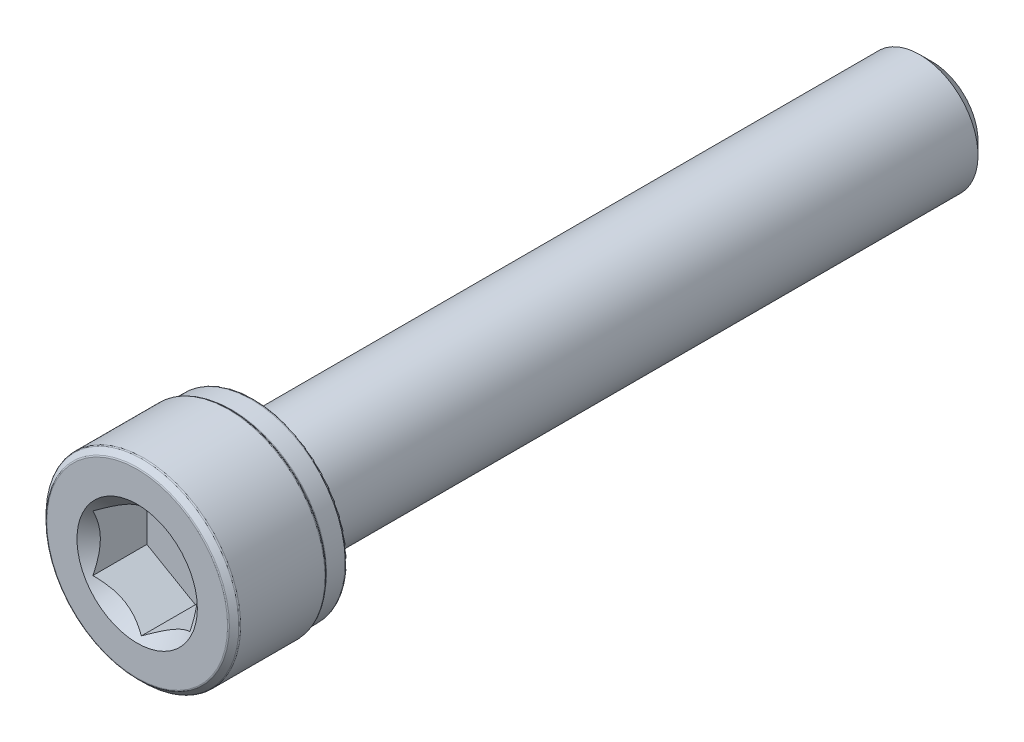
from build123d import *

# Parameters (mm, degrees)
CUT_EXTRUDE1_START = -3
CUT_EXTRUDE1_DEPTH = 3
SKETCH4_R          = 3.103257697
CUT_EXTRUDE2_DEPTH = 3
CUT_EXTRUDE2_TAPER = 45


with BuildPart() as part:
    # Sketch2 → Revolve1 (revolve)
    with BuildSketch(Plane(origin=(0, 0, 0), x_dir=(0, 0, -1), z_dir=(1, 0, 0))):
        with BuildLine():
            Line((-20.5, 0), (-20.5, 4.661167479))
            ThreePointArc((-20.5, 4.661167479), (-20.492863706, 4.69704405), (-20.472541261, 4.727458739))
            Line((-20.472541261, 4.727458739), (-20.227458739, 4.972541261))
            ThreePointArc((-20.227458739, 4.972541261), (-20.19704405, 4.992863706), (-20.161167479, 5))
            Line((-20.161167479, 5), (-15.813832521, 5))
            ThreePointArc((-15.813832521, 5), (-15.77795595, 4.992863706), (-15.747541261, 4.972541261))
            Line((-15.747541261, 4.972541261), (-15.652458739, 4.877458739))
            ThreePointArc((-15.652458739, 4.877458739), (-15.62204405, 4.857136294), (-15.586167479, 4.85))
            Line((-15.586167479, 4.85), (-14.625, 4.85))
            ThreePointArc((-14.625, 4.85), (-14.536611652, 4.813388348), (-14.5, 4.725))
            Line((-14.5, 4.725), (-14.5, 3.3))
            ThreePointArc((-14.5, 3.3), (-14.412132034, 3.087867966), (-14.2, 3))
            Line((-14.2, 3), (19.850480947, 3))
            Line((19.850480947, 3), (20.5, 2.350480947))
            Line((20.5, 2.350480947), (20.5, 0))
            Line((20.5, 0), (-20.5, 0))
        make_face()
    revolve(axis=Axis((0, 0, -20.5), (0, 0, 1)))

    # Sketch3 → Cut-Extrude1 (cut)
    with BuildSketch(Plane.XY.offset(20.5).offset(CUT_EXTRUDE1_START)):
        Polygon((2.5, -1.443375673), (2.5, 1.443375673), (0, 2.886751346), (-2.5, 1.443375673), (-2.5, -1.443375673), (0, -2.886751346), align=None)
    extrude(amount=CUT_EXTRUDE1_DEPTH, mode=Mode.SUBTRACT)

    # Sketch4 → Cut-Extrude2 (cut)
    with BuildSketch(Plane.XY.offset(20.5)):
        Circle(SKETCH4_R)
    extrude(amount=-CUT_EXTRUDE2_DEPTH, taper=CUT_EXTRUDE2_TAPER, mode=Mode.SUBTRACT)


solid = part.part
